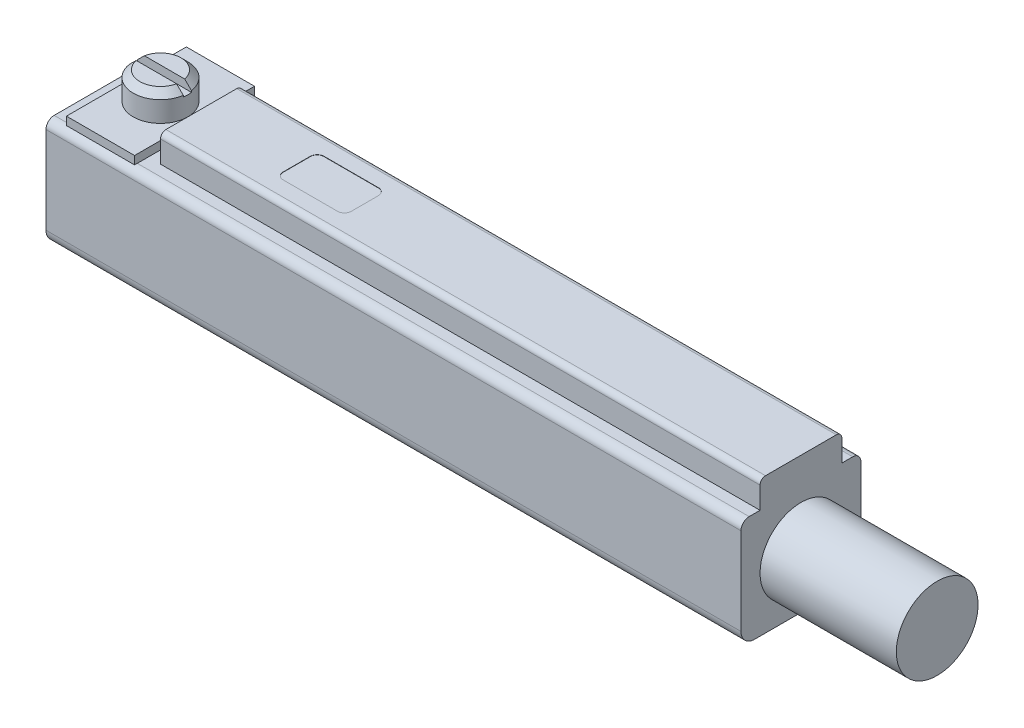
ISO-10303-21;
HEADER;
FILE_DESCRIPTION(('STEP AP214'),'2;1');
FILE_NAME('part.step','',(''),(''),'','','');
FILE_SCHEMA(('AUTOMOTIVE_DESIGN { 1 0 10303 214 1 1 1 1 }'));
ENDSEC;
DATA;
#1=APPLICATION_CONTEXT('core data for automotive mechanical design processes');
#2=APPLICATION_PROTOCOL_DEFINITION('international standard','automotive_design',2000,#1);
#3=PRODUCT_CONTEXT('',#1,'mechanical');
#4=PRODUCT('Part','Part','',(#3));
#5=PRODUCT_RELATED_PRODUCT_CATEGORY('part','',(#4));
#6=PRODUCT_DEFINITION_FORMATION('','',#4);
#7=PRODUCT_DEFINITION_CONTEXT('part definition',#1,'design');
#8=PRODUCT_DEFINITION('design','',#6,#7);
#9=PRODUCT_DEFINITION_SHAPE('','',#8);
#10=(LENGTH_UNIT() NAMED_UNIT(*) SI_UNIT(.MILLI.,.METRE.));
#11=(NAMED_UNIT(*) PLANE_ANGLE_UNIT() SI_UNIT($,.RADIAN.));
#12=(NAMED_UNIT(*) SI_UNIT($,.STERADIAN.) SOLID_ANGLE_UNIT());
#13=UNCERTAINTY_MEASURE_WITH_UNIT(LENGTH_MEASURE(1.E-05),#10,'distance_accuracy_value','');
#14=(GEOMETRIC_REPRESENTATION_CONTEXT(3) GLOBAL_UNCERTAINTY_ASSIGNED_CONTEXT((#13)) GLOBAL_UNIT_ASSIGNED_CONTEXT((#10,
#11,#12)) REPRESENTATION_CONTEXT('',''));
#15=CARTESIAN_POINT('',(0.,0.,0.));
#16=DIRECTION('',(0.,0.,1.));
#17=DIRECTION('',(1.,0.,0.));
#18=AXIS2_PLACEMENT_3D('',#15,#16,#17);
#19=CARTESIAN_POINT('',(0.75,5.5,0.150000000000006));
#20=DIRECTION('',(0.,0.,1.));
#21=DIRECTION('',(0.,-1.,0.));
#22=AXIS2_PLACEMENT_3D('',#19,#20,#21);
#23=PLANE('',#22);
#24=DIRECTION('',(0.,-1.,0.));
#25=VECTOR('',#24,1.);
#26=CARTESIAN_POINT('',(1.01131400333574,5.5,0.150000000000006));
#27=LINE('',#26,#25);
#28=CARTESIAN_POINT('',(1.01131400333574,5.25450000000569,0.150000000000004));
#29=VERTEX_POINT('',#28);
#30=CARTESIAN_POINT('',(1.01131400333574,5.2,0.150000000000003));
#31=VERTEX_POINT('',#30);
#32=EDGE_CURVE('E227',#29,#31,#27,.T.);
#33=ORIENTED_EDGE('',*,*,#32,.F.);
#34=CARTESIAN_POINT('',(1.26056085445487,5.49999999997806,0.150000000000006));
#35=CARTESIAN_POINT('',(1.2189316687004,5.45917270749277,0.150000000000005));
#36=CARTESIAN_POINT('',(1.17734650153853,5.41830072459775,0.150000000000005));
#37=CARTESIAN_POINT('',(1.09426421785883,5.33646739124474,0.150000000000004));
#38=CARTESIAN_POINT('',(1.05276710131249,5.29550604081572,0.150000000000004));
#39=CARTESIAN_POINT('',(1.01131400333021,5.25450000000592,0.150000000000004));
#40=B_SPLINE_CURVE_WITH_KNOTS('',3,(#34,#35,#36,#37,#38,#39),.UNSPECIFIED.,.F.,.F.,(4,2,4),(0.,
0.174924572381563,0.349849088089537),.UNSPECIFIED.);
#41=CARTESIAN_POINT('',(1.26056085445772,5.49999999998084,0.150000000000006));
#42=VERTEX_POINT('',#41);
#43=EDGE_CURVE('E209',#42,#29,#40,.T.);
#44=ORIENTED_EDGE('',*,*,#43,.F.);
#45=DIRECTION('',(1.,0.,0.));
#46=VECTOR('',#45,1.);
#47=CARTESIAN_POINT('',(0.75,5.5,0.150000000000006));
#48=LINE('',#47,#46);
#49=CARTESIAN_POINT('',(2.73943914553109,5.49999999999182,0.150000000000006));
#50=VERTEX_POINT('',#49);
#51=EDGE_CURVE('E206',#50,#42,#48,.F.);
#52=ORIENTED_EDGE('',*,*,#51,.F.);
#53=CARTESIAN_POINT('',(2.98868599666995,5.25450000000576,0.150000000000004));
#54=CARTESIAN_POINT('',(2.94723289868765,5.29550604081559,0.150000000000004));
#55=CARTESIAN_POINT('',(2.90573578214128,5.33646739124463,0.150000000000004));
#56=CARTESIAN_POINT('',(2.82265349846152,5.41830072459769,0.150000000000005));
#57=CARTESIAN_POINT('',(2.78106833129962,5.45917270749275,0.150000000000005));
#58=CARTESIAN_POINT('',(2.73943914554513,5.49999999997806,0.150000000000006));
#59=B_SPLINE_CURVE_WITH_KNOTS('',3,(#53,#54,#55,#56,#57,#58),.UNSPECIFIED.,.F.,.F.,(4,2,4),(0.,
0.174924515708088,0.349849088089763),.UNSPECIFIED.);
#60=CARTESIAN_POINT('',(2.98868599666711,5.25450000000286,0.150000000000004));
#61=VERTEX_POINT('',#60);
#62=EDGE_CURVE('E21',#61,#50,#59,.T.);
#63=ORIENTED_EDGE('',*,*,#62,.F.);
#64=DIRECTION('',(0.,-1.,0.));
#65=VECTOR('',#64,1.);
#66=CARTESIAN_POINT('',(2.98868599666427,5.5,0.150000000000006));
#67=LINE('',#66,#65);
#68=CARTESIAN_POINT('',(2.98868599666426,5.2,0.150000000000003));
#69=VERTEX_POINT('',#68);
#70=EDGE_CURVE('E219',#69,#61,#67,.F.);
#71=ORIENTED_EDGE('',*,*,#70,.F.);
#72=DIRECTION('',(1.,0.,0.));
#73=VECTOR('',#72,1.);
#74=CARTESIAN_POINT('',(0.75,5.2,0.150000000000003));
#75=LINE('',#74,#73);
#76=EDGE_CURVE('E355',#69,#31,#75,.F.);
#77=ORIENTED_EDGE('',*,*,#76,.T.);
#78=EDGE_LOOP('',(#33,#44,#52,#63,#71,#77));
#79=FACE_BOUND('',#78,.T.);
#80=ADVANCED_FACE('F17',(#79),#23,.F.);
#81=CARTESIAN_POINT('',(0.75,5.2,0.150000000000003));
#82=DIRECTION('',(0.,-1.,0.));
#83=DIRECTION('',(0.,0.,-1.));
#84=AXIS2_PLACEMENT_3D('',#81,#82,#83);
#85=PLANE('',#84);
#86=CARTESIAN_POINT('',(2.,5.2,0.));
#87=DIRECTION('',(0.,1.,0.));
#88=DIRECTION('',(0.,0.,1.));
#89=AXIS2_PLACEMENT_3D('',#86,#87,#88);
#90=CIRCLE('',#89,1.);
#91=CARTESIAN_POINT('',(1.01131400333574,5.2,-0.149999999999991));
#92=VERTEX_POINT('',#91);
#93=EDGE_CURVE('E356',#31,#92,#90,.F.);
#94=ORIENTED_EDGE('',*,*,#93,.F.);
#95=ORIENTED_EDGE('',*,*,#76,.F.);
#96=CARTESIAN_POINT('',(2.,5.2,0.));
#97=DIRECTION('',(0.,1.,0.));
#98=DIRECTION('',(0.,0.,1.));
#99=AXIS2_PLACEMENT_3D('',#96,#97,#98);
#100=CIRCLE('',#99,1.);
#101=CARTESIAN_POINT('',(2.98868599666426,5.2,-0.149999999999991));
#102=VERTEX_POINT('',#101);
#103=EDGE_CURVE('E228',#102,#69,#100,.F.);
#104=ORIENTED_EDGE('',*,*,#103,.F.);
#105=DIRECTION('',(-1.,0.,0.));
#106=VECTOR('',#105,1.);
#107=CARTESIAN_POINT('',(0.75,5.2,-0.149999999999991));
#108=LINE('',#107,#106);
#109=EDGE_CURVE('E368',#102,#92,#108,.T.);
#110=ORIENTED_EDGE('',*,*,#109,.T.);
#111=EDGE_LOOP('',(#94,#95,#104,#110));
#112=FACE_BOUND('',#111,.T.);
#113=ADVANCED_FACE('F380',(#112),#85,.F.);
#114=CARTESIAN_POINT('',(0.75,5.2,-0.149999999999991));
#115=DIRECTION('',(0.,0.,-1.));
#116=DIRECTION('',(-1.,0.,0.));
#117=AXIS2_PLACEMENT_3D('',#114,#115,#116);
#118=PLANE('',#117);
#119=DIRECTION('',(0.,1.,0.));
#120=VECTOR('',#119,1.);
#121=CARTESIAN_POINT('',(2.98868599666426,5.2,-0.149999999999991));
#122=LINE('',#121,#120);
#123=CARTESIAN_POINT('',(2.98868599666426,5.25450000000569,-0.149999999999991));
#124=VERTEX_POINT('',#123);
#125=EDGE_CURVE('E329',#124,#102,#122,.F.);
#126=ORIENTED_EDGE('',*,*,#125,.F.);
#127=CARTESIAN_POINT('',(2.73943914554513,5.49999999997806,-0.149999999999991));
#128=CARTESIAN_POINT('',(2.78106833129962,5.45917270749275,-0.149999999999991));
#129=CARTESIAN_POINT('',(2.82265349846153,5.41830072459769,-0.149999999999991));
#130=CARTESIAN_POINT('',(2.90573578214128,5.33646739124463,-0.149999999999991));
#131=CARTESIAN_POINT('',(2.94723289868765,5.29550604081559,-0.149999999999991));
#132=CARTESIAN_POINT('',(2.98868599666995,5.25450000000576,-0.149999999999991));
#133=B_SPLINE_CURVE_WITH_KNOTS('',3,(#127,#128,#129,#130,#131,#132),.UNSPECIFIED.,.F.,.F.,(4,2,
4),(0.,0.174924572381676,0.349849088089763),.UNSPECIFIED.);
#134=CARTESIAN_POINT('',(2.73943914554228,5.49999999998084,-0.149999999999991));
#135=VERTEX_POINT('',#134);
#136=EDGE_CURVE('E321',#135,#124,#133,.T.);
#137=ORIENTED_EDGE('',*,*,#136,.F.);
#138=DIRECTION('',(1.,0.,0.));
#139=VECTOR('',#138,1.);
#140=CARTESIAN_POINT('',(2.,5.5,-0.149999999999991));
#141=LINE('',#140,#139);
#142=CARTESIAN_POINT('',(1.26056085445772,5.49999999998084,-0.149999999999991));
#143=VERTEX_POINT('',#142);
#144=EDGE_CURVE('E216',#135,#143,#141,.F.);
#145=ORIENTED_EDGE('',*,*,#144,.T.);
#146=CARTESIAN_POINT('',(1.01131400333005,5.25450000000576,-0.149999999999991));
#147=CARTESIAN_POINT('',(1.05276710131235,5.29550604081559,-0.149999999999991));
#148=CARTESIAN_POINT('',(1.09426421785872,5.33646739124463,-0.149999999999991));
#149=CARTESIAN_POINT('',(1.17734650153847,5.41830072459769,-0.149999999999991));
#150=CARTESIAN_POINT('',(1.21893166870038,5.45917270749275,-0.149999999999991));
#151=CARTESIAN_POINT('',(1.26056085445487,5.49999999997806,-0.149999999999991));
#152=B_SPLINE_CURVE_WITH_KNOTS('',3,(#146,#147,#148,#149,#150,#151),.UNSPECIFIED.,.F.,.F.,(4,2,
4),(0.,0.174924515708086,0.34984908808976),.UNSPECIFIED.);
#153=CARTESIAN_POINT('',(1.01131400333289,5.25450000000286,-0.149999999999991));
#154=VERTEX_POINT('',#153);
#155=EDGE_CURVE('E330',#154,#143,#152,.T.);
#156=ORIENTED_EDGE('',*,*,#155,.F.);
#157=DIRECTION('',(0.,1.,0.));
#158=VECTOR('',#157,1.);
#159=CARTESIAN_POINT('',(1.01131400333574,5.2,-0.149999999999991));
#160=LINE('',#159,#158);
#161=EDGE_CURVE('E225',#92,#154,#160,.T.);
#162=ORIENTED_EDGE('',*,*,#161,.F.);
#163=ORIENTED_EDGE('',*,*,#109,.F.);
#164=EDGE_LOOP('',(#126,#137,#145,#156,#162,#163));
#165=FACE_BOUND('',#164,.T.);
#166=ADVANCED_FACE('F335',(#165),#118,.F.);
#167=CARTESIAN_POINT('',(2.,5.5,0.));
#168=DIRECTION('',(0.,-1.,0.));
#169=DIRECTION('',(0.,0.,-1.));
#170=AXIS2_PLACEMENT_3D('',#167,#168,#169);
#171=PLANE('',#170);
#172=ORIENTED_EDGE('',*,*,#51,.T.);
#173=CARTESIAN_POINT('',(2.,5.49999999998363,0.));
#174=DIRECTION('',(0.,-1.,0.));
#175=DIRECTION('',(0.,0.,-1.));
#176=AXIS2_PLACEMENT_3D('',#173,#174,#175);
#177=CIRCLE('',#176,0.754499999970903);
#178=EDGE_CURVE('E213',#50,#42,#177,.T.);
#179=ORIENTED_EDGE('',*,*,#178,.F.);
#180=EDGE_LOOP('',(#172,#179));
#181=FACE_BOUND('',#180,.T.);
#182=ADVANCED_FACE('F214',(#181),#171,.F.);
#183=CARTESIAN_POINT('',(2.,5.5,0.));
#184=DIRECTION('',(0.,-1.,0.));
#185=DIRECTION('',(0.,0.,-1.));
#186=AXIS2_PLACEMENT_3D('',#183,#184,#185);
#187=PLANE('',#186);
#188=CARTESIAN_POINT('',(2.,5.49999999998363,0.));
#189=DIRECTION('',(0.,-1.,0.));
#190=DIRECTION('',(0.,0.,-1.));
#191=AXIS2_PLACEMENT_3D('',#188,#189,#190);
#192=CIRCLE('',#191,0.754499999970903);
#193=EDGE_CURVE('E215',#143,#135,#192,.T.);
#194=ORIENTED_EDGE('',*,*,#193,.F.);
#195=ORIENTED_EDGE('',*,*,#144,.F.);
#196=EDGE_LOOP('',(#194,#195));
#197=FACE_BOUND('',#196,.T.);
#198=ADVANCED_FACE('F349',(#197),#187,.F.);
#199=CARTESIAN_POINT('',(2.,5.25450000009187,0.));
#200=DIRECTION('',(0.,-1.,0.));
#201=DIRECTION('',(0.,0.,-1.));
#202=AXIS2_PLACEMENT_3D('',#199,#200,#201);
#203=CONICAL_SURFACE('',#202,0.999999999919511,0.785398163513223);
#204=ORIENTED_EDGE('',*,*,#178,.T.);
#205=ORIENTED_EDGE('',*,*,#43,.T.);
#206=CARTESIAN_POINT('',(2.,5.2545,0.));
#207=DIRECTION('',(0.,1.,0.));
#208=DIRECTION('',(0.,0.,1.));
#209=AXIS2_PLACEMENT_3D('',#206,#207,#208);
#210=CIRCLE('',#209,1.);
#211=EDGE_CURVE('E201',#61,#29,#210,.F.);
#212=ORIENTED_EDGE('',*,*,#211,.F.);
#213=ORIENTED_EDGE('',*,*,#62,.T.);
#214=EDGE_LOOP('',(#204,#205,#212,#213));
#215=FACE_BOUND('',#214,.T.);
#216=ADVANCED_FACE('F218',(#215),#203,.T.);
#217=CARTESIAN_POINT('',(2.,5.25450000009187,0.));
#218=DIRECTION('',(0.,-1.,0.));
#219=DIRECTION('',(0.,0.,-1.));
#220=AXIS2_PLACEMENT_3D('',#217,#218,#219);
#221=CONICAL_SURFACE('',#220,0.999999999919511,0.785398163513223);
#222=CARTESIAN_POINT('',(2.,5.25449999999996,0.));
#223=DIRECTION('',(0.,1.,0.));
#224=DIRECTION('',(0.,0.,1.));
#225=AXIS2_PLACEMENT_3D('',#222,#223,#224);
#226=CIRCLE('',#225,1.);
#227=EDGE_CURVE('E319',#154,#124,#226,.F.);
#228=ORIENTED_EDGE('',*,*,#227,.F.);
#229=ORIENTED_EDGE('',*,*,#155,.T.);
#230=ORIENTED_EDGE('',*,*,#193,.T.);
#231=ORIENTED_EDGE('',*,*,#136,.T.);
#232=EDGE_LOOP('',(#228,#229,#230,#231));
#233=FACE_BOUND('',#232,.T.);
#234=ADVANCED_FACE('F338',(#233),#221,.T.);
#235=CARTESIAN_POINT('',(2.,3.9,0.));
#236=DIRECTION('',(0.,1.,0.));
#237=DIRECTION('',(0.,0.,1.));
#238=AXIS2_PLACEMENT_3D('',#235,#236,#237);
#239=CYLINDRICAL_SURFACE('',#238,1.);
#240=CARTESIAN_POINT('',(2.,4.50000000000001,0.));
#241=DIRECTION('',(0.,1.,0.));
#242=DIRECTION('',(0.,0.,1.));
#243=AXIS2_PLACEMENT_3D('',#240,#241,#242);
#244=CIRCLE('',#243,1.);
#245=CARTESIAN_POINT('',(2.,4.50000000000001,1.00000000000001));
#246=VERTEX_POINT('',#245);
#247=EDGE_CURVE('E315',#246,#246,#244,.T.);
#248=ORIENTED_EDGE('',*,*,#247,.T.);
#249=EDGE_LOOP('',(#248));
#250=FACE_BOUND('',#249,.T.);
#251=ORIENTED_EDGE('',*,*,#161,.T.);
#252=ORIENTED_EDGE('',*,*,#227,.T.);
#253=ORIENTED_EDGE('',*,*,#125,.T.);
#254=ORIENTED_EDGE('',*,*,#103,.T.);
#255=ORIENTED_EDGE('',*,*,#70,.T.);
#256=ORIENTED_EDGE('',*,*,#211,.T.);
#257=ORIENTED_EDGE('',*,*,#32,.T.);
#258=ORIENTED_EDGE('',*,*,#93,.T.);
#259=EDGE_LOOP('',(#251,#252,#253,#254,#255,#256,#257,#258));
#260=FACE_BOUND('',#259,.T.);
#261=ADVANCED_FACE('F342',(#250,#260),#239,.T.);
#262=CARTESIAN_POINT('',(3.25,4.5,-2.2));
#263=DIRECTION('',(0.,-1.,0.));
#264=DIRECTION('',(0.,0.,-1.));
#265=AXIS2_PLACEMENT_3D('',#262,#263,#264);
#266=PLANE('',#265);
#267=ORIENTED_EDGE('',*,*,#247,.F.);
#268=EDGE_LOOP('',(#267));
#269=FACE_BOUND('',#268,.T.);
#270=DIRECTION('',(0.,0.,-1.));
#271=VECTOR('',#270,1.);
#272=CARTESIAN_POINT('',(0.75,4.5,0.));
#273=LINE('',#272,#271);
#274=CARTESIAN_POINT('',(0.75,4.5,-2.2));
#275=VERTEX_POINT('',#274);
#276=CARTESIAN_POINT('',(0.75,4.5,2.2));
#277=VERTEX_POINT('',#276);
#278=EDGE_CURVE('E535',#275,#277,#273,.F.);
#279=ORIENTED_EDGE('',*,*,#278,.T.);
#280=DIRECTION('',(-1.,0.,0.));
#281=VECTOR('',#280,1.);
#282=CARTESIAN_POINT('',(3.25,4.5,2.2));
#283=LINE('',#282,#281);
#284=CARTESIAN_POINT('',(3.25,4.5,2.2));
#285=VERTEX_POINT('',#284);
#286=EDGE_CURVE('E539',#277,#285,#283,.F.);
#287=ORIENTED_EDGE('',*,*,#286,.T.);
#288=DIRECTION('',(0.,0.,-1.));
#289=VECTOR('',#288,1.);
#290=CARTESIAN_POINT('',(3.25,4.5,0.));
#291=LINE('',#290,#289);
#292=CARTESIAN_POINT('',(3.25,4.5,-2.2));
#293=VERTEX_POINT('',#292);
#294=EDGE_CURVE('E318',#293,#285,#291,.F.);
#295=ORIENTED_EDGE('',*,*,#294,.F.);
#296=DIRECTION('',(1.,0.,0.));
#297=VECTOR('',#296,1.);
#298=CARTESIAN_POINT('',(3.25,4.5,-2.2));
#299=LINE('',#298,#297);
#300=EDGE_CURVE('E542',#293,#275,#299,.F.);
#301=ORIENTED_EDGE('',*,*,#300,.T.);
#302=EDGE_LOOP('',(#279,#287,#295,#301));
#303=FACE_BOUND('',#302,.T.);
#304=ADVANCED_FACE('F520',(#269,#303),#266,.F.);
#305=CARTESIAN_POINT('',(3.25,0.,0.));
#306=DIRECTION('',(1.,0.,0.));
#307=DIRECTION('',(0.,0.,-1.));
#308=AXIS2_PLACEMENT_3D('',#305,#306,#307);
#309=PLANE('',#308);
#310=DIRECTION('',(0.,1.,0.));
#311=VECTOR('',#310,1.);
#312=CARTESIAN_POINT('',(3.25,4.2,-2.2));
#313=LINE('',#312,#311);
#314=CARTESIAN_POINT('',(3.25,4.2,-2.2));
#315=VERTEX_POINT('',#314);
#316=EDGE_CURVE('E568',#315,#293,#313,.T.);
#317=ORIENTED_EDGE('',*,*,#316,.T.);
#318=ORIENTED_EDGE('',*,*,#294,.T.);
#319=DIRECTION('',(0.,1.,0.));
#320=VECTOR('',#319,1.);
#321=CARTESIAN_POINT('',(3.25,4.5,2.2));
#322=LINE('',#321,#320);
#323=CARTESIAN_POINT('',(3.25,4.2,2.2));
#324=VERTEX_POINT('',#323);
#325=EDGE_CURVE('E548',#285,#324,#322,.F.);
#326=ORIENTED_EDGE('',*,*,#325,.T.);
#327=DIRECTION('',(0.,0.,1.));
#328=VECTOR('',#327,1.);
#329=CARTESIAN_POINT('',(3.25,4.2,2.2));
#330=LINE('',#329,#328);
#331=EDGE_CURVE('E557',#324,#315,#330,.F.);
#332=ORIENTED_EDGE('',*,*,#331,.T.);
#333=EDGE_LOOP('',(#317,#318,#326,#332));
#334=FACE_BOUND('',#333,.T.);
#335=ADVANCED_FACE('F517',(#334),#309,.T.);
#336=CARTESIAN_POINT('',(3.25,4.2,-2.2));
#337=DIRECTION('',(0.,0.,1.));
#338=DIRECTION('',(1.,0.,0.));
#339=AXIS2_PLACEMENT_3D('',#336,#337,#338);
#340=PLANE('',#339);
#341=DIRECTION('',(0.,1.,0.));
#342=VECTOR('',#341,1.);
#343=CARTESIAN_POINT('',(0.75,0.,-2.2));
#344=LINE('',#343,#342);
#345=CARTESIAN_POINT('',(0.75,4.2,-2.2));
#346=VERTEX_POINT('',#345);
#347=EDGE_CURVE('E549',#346,#275,#344,.T.);
#348=ORIENTED_EDGE('',*,*,#347,.T.);
#349=ORIENTED_EDGE('',*,*,#300,.F.);
#350=ORIENTED_EDGE('',*,*,#316,.F.);
#351=DIRECTION('',(1.,0.,0.));
#352=VECTOR('',#351,1.);
#353=CARTESIAN_POINT('',(3.25,4.2,-2.2));
#354=LINE('',#353,#352);
#355=EDGE_CURVE('E583',#315,#346,#354,.F.);
#356=ORIENTED_EDGE('',*,*,#355,.T.);
#357=EDGE_LOOP('',(#348,#349,#350,#356));
#358=FACE_BOUND('',#357,.T.);
#359=ADVANCED_FACE('F513',(#358),#340,.F.);
#360=CARTESIAN_POINT('',(0.75,0.,0.));
#361=DIRECTION('',(1.,0.,0.));
#362=DIRECTION('',(0.,0.,-1.));
#363=AXIS2_PLACEMENT_3D('',#360,#361,#362);
#364=PLANE('',#363);
#365=ORIENTED_EDGE('',*,*,#278,.F.);
#366=ORIENTED_EDGE('',*,*,#347,.F.);
#367=DIRECTION('',(0.,0.,1.));
#368=VECTOR('',#367,1.);
#369=CARTESIAN_POINT('',(0.75,4.2,2.2));
#370=LINE('',#369,#368);
#371=CARTESIAN_POINT('',(0.75,4.2,2.2));
#372=VERTEX_POINT('',#371);
#373=EDGE_CURVE('E561',#346,#372,#370,.T.);
#374=ORIENTED_EDGE('',*,*,#373,.T.);
#375=DIRECTION('',(0.,1.,0.));
#376=VECTOR('',#375,1.);
#377=CARTESIAN_POINT('',(0.75,4.5,2.2));
#378=LINE('',#377,#376);
#379=EDGE_CURVE('E554',#372,#277,#378,.T.);
#380=ORIENTED_EDGE('',*,*,#379,.T.);
#381=EDGE_LOOP('',(#365,#366,#374,#380));
#382=FACE_BOUND('',#381,.T.);
#383=ADVANCED_FACE('F509',(#382),#364,.F.);
#384=CARTESIAN_POINT('',(3.25,4.5,2.2));
#385=DIRECTION('',(0.,0.,-1.));
#386=DIRECTION('',(-1.,0.,0.));
#387=AXIS2_PLACEMENT_3D('',#384,#385,#386);
#388=PLANE('',#387);
#389=ORIENTED_EDGE('',*,*,#379,.F.);
#390=DIRECTION('',(1.,0.,0.));
#391=VECTOR('',#390,1.);
#392=CARTESIAN_POINT('',(3.25,4.2,2.2));
#393=LINE('',#392,#391);
#394=EDGE_CURVE('E314',#372,#324,#393,.T.);
#395=ORIENTED_EDGE('',*,*,#394,.T.);
#396=ORIENTED_EDGE('',*,*,#325,.F.);
#397=ORIENTED_EDGE('',*,*,#286,.F.);
#398=EDGE_LOOP('',(#389,#395,#396,#397));
#399=FACE_BOUND('',#398,.T.);
#400=ADVANCED_FACE('F505',(#399),#388,.F.);
#401=CARTESIAN_POINT('',(7.25,4.99,0.5));
#402=DIRECTION('',(0.,1.,0.));
#403=DIRECTION('',(0.,0.,1.));
#404=AXIS2_PLACEMENT_3D('',#401,#402,#403);
#405=PLANE('',#404);
#406=CARTESIAN_POINT('',(7.25,4.99,-0.500000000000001));
#407=DIRECTION('',(0.,1.,0.));
#408=DIRECTION('',(0.,0.,1.));
#409=AXIS2_PLACEMENT_3D('',#406,#407,#408);
#410=CIRCLE('',#409,0.249999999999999);
#411=CARTESIAN_POINT('',(7.25,4.99,-0.75));
#412=VERTEX_POINT('',#411);
#413=CARTESIAN_POINT('',(7.,4.99,-0.5));
#414=VERTEX_POINT('',#413);
#415=EDGE_CURVE('E303',#412,#414,#410,.T.);
#416=ORIENTED_EDGE('',*,*,#415,.T.);
#417=DIRECTION('',(0.,0.,1.));
#418=VECTOR('',#417,1.);
#419=CARTESIAN_POINT('',(7.,4.99,-0.5));
#420=LINE('',#419,#418);
#421=CARTESIAN_POINT('',(7.,4.99,0.5));
#422=VERTEX_POINT('',#421);
#423=EDGE_CURVE('E600',#414,#422,#420,.T.);
#424=ORIENTED_EDGE('',*,*,#423,.T.);
#425=CARTESIAN_POINT('',(7.25,4.99,0.5));
#426=DIRECTION('',(0.,1.,0.));
#427=DIRECTION('',(0.,0.,1.));
#428=AXIS2_PLACEMENT_3D('',#425,#426,#427);
#429=CIRCLE('',#428,0.25);
#430=CARTESIAN_POINT('',(7.25,4.99,0.75));
#431=VERTEX_POINT('',#430);
#432=EDGE_CURVE('E300',#422,#431,#429,.T.);
#433=ORIENTED_EDGE('',*,*,#432,.T.);
#434=DIRECTION('',(1.,0.,0.));
#435=VECTOR('',#434,1.);
#436=CARTESIAN_POINT('',(7.25,4.99,0.75));
#437=LINE('',#436,#435);
#438=CARTESIAN_POINT('',(9.25,4.99,0.75));
#439=VERTEX_POINT('',#438);
#440=EDGE_CURVE('E299',#431,#439,#437,.T.);
#441=ORIENTED_EDGE('',*,*,#440,.T.);
#442=CARTESIAN_POINT('',(9.25,4.99,0.500000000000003));
#443=DIRECTION('',(0.,1.,0.));
#444=DIRECTION('',(0.,0.,1.));
#445=AXIS2_PLACEMENT_3D('',#442,#443,#444);
#446=CIRCLE('',#445,0.249999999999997);
#447=CARTESIAN_POINT('',(9.5,4.99,0.500000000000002));
#448=VERTEX_POINT('',#447);
#449=EDGE_CURVE('E311',#439,#448,#446,.T.);
#450=ORIENTED_EDGE('',*,*,#449,.T.);
#451=DIRECTION('',(0.,0.,-1.));
#452=VECTOR('',#451,1.);
#453=CARTESIAN_POINT('',(9.5,4.99,0.5));
#454=LINE('',#453,#452);
#455=CARTESIAN_POINT('',(9.5,4.99,-0.5));
#456=VERTEX_POINT('',#455);
#457=EDGE_CURVE('E603',#448,#456,#454,.T.);
#458=ORIENTED_EDGE('',*,*,#457,.T.);
#459=CARTESIAN_POINT('',(9.25,4.99,-0.500000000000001));
#460=DIRECTION('',(0.,1.,0.));
#461=DIRECTION('',(0.,0.,1.));
#462=AXIS2_PLACEMENT_3D('',#459,#460,#461);
#463=CIRCLE('',#462,0.249999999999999);
#464=CARTESIAN_POINT('',(9.25,4.99,-0.75));
#465=VERTEX_POINT('',#464);
#466=EDGE_CURVE('E307',#456,#465,#463,.T.);
#467=ORIENTED_EDGE('',*,*,#466,.T.);
#468=DIRECTION('',(-1.,0.,0.));
#469=VECTOR('',#468,1.);
#470=CARTESIAN_POINT('',(9.25,4.99,-0.75));
#471=LINE('',#470,#469);
#472=EDGE_CURVE('E602',#465,#412,#471,.T.);
#473=ORIENTED_EDGE('',*,*,#472,.T.);
#474=EDGE_LOOP('',(#416,#424,#433,#441,#450,#458,#467,#473));
#475=FACE_BOUND('',#474,.T.);
#476=ADVANCED_FACE('F501',(#475),#405,.T.);
#477=CARTESIAN_POINT('',(3.25,4.2,2.2));
#478=DIRECTION('',(0.,1.,0.));
#479=DIRECTION('',(0.,0.,1.));
#480=AXIS2_PLACEMENT_3D('',#477,#478,#479);
#481=PLANE('',#480);
#482=CARTESIAN_POINT('',(2.,4.2,0.));
#483=DIRECTION('',(0.,1.,0.));
#484=DIRECTION('',(0.,0.,1.));
#485=AXIS2_PLACEMENT_3D('',#482,#483,#484);
#486=CIRCLE('',#485,1.);
#487=CARTESIAN_POINT('',(2.,4.20000000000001,1.00000000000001));
#488=VERTEX_POINT('',#487);
#489=EDGE_CURVE('E272',#488,#488,#486,.F.);
#490=ORIENTED_EDGE('',*,*,#489,.F.);
#491=EDGE_LOOP('',(#490));
#492=FACE_BOUND('',#491,.T.);
#493=ORIENTED_EDGE('',*,*,#373,.F.);
#494=ORIENTED_EDGE('',*,*,#355,.F.);
#495=ORIENTED_EDGE('',*,*,#331,.F.);
#496=ORIENTED_EDGE('',*,*,#394,.F.);
#497=EDGE_LOOP('',(#493,#494,#495,#496));
#498=FACE_BOUND('',#497,.T.);
#499=ADVANCED_FACE('F497',(#492,#498),#481,.F.);
#500=CARTESIAN_POINT('',(9.25,4.99,0.500000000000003));
#501=DIRECTION('',(0.,1.,0.));
#502=DIRECTION('',(0.,0.,1.));
#503=AXIS2_PLACEMENT_3D('',#500,#501,#502);
#504=CYLINDRICAL_SURFACE('',#503,0.249999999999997);
#505=DIRECTION('',(0.,1.,0.));
#506=VECTOR('',#505,1.);
#507=CARTESIAN_POINT('',(9.5,4.99,0.5));
#508=LINE('',#507,#506);
#509=CARTESIAN_POINT('',(9.5,5.,0.500000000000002));
#510=VERTEX_POINT('',#509);
#511=EDGE_CURVE('E313',#510,#448,#508,.F.);
#512=ORIENTED_EDGE('',*,*,#511,.T.);
#513=ORIENTED_EDGE('',*,*,#449,.F.);
#514=DIRECTION('',(0.,1.,0.));
#515=VECTOR('',#514,1.);
#516=CARTESIAN_POINT('',(9.25,4.99,0.75));
#517=LINE('',#516,#515);
#518=CARTESIAN_POINT('',(9.25,5.,0.75));
#519=VERTEX_POINT('',#518);
#520=EDGE_CURVE('E295',#439,#519,#517,.T.);
#521=ORIENTED_EDGE('',*,*,#520,.T.);
#522=CARTESIAN_POINT('',(9.25,5.,0.500000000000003));
#523=DIRECTION('',(0.,1.,0.));
#524=DIRECTION('',(0.,0.,1.));
#525=AXIS2_PLACEMENT_3D('',#522,#523,#524);
#526=CIRCLE('',#525,0.249999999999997);
#527=EDGE_CURVE('E269',#519,#510,#526,.T.);
#528=ORIENTED_EDGE('',*,*,#527,.T.);
#529=EDGE_LOOP('',(#512,#513,#521,#528));
#530=FACE_BOUND('',#529,.T.);
#531=ADVANCED_FACE('F493',(#530),#504,.F.);
#532=CARTESIAN_POINT('',(9.5,4.99,0.5));
#533=DIRECTION('',(1.,0.,0.));
#534=DIRECTION('',(0.,0.,-1.));
#535=AXIS2_PLACEMENT_3D('',#532,#533,#534);
#536=PLANE('',#535);
#537=DIRECTION('',(0.,1.,0.));
#538=VECTOR('',#537,1.);
#539=CARTESIAN_POINT('',(9.5,4.99,-0.5));
#540=LINE('',#539,#538);
#541=CARTESIAN_POINT('',(9.5,5.,-0.5));
#542=VERTEX_POINT('',#541);
#543=EDGE_CURVE('E310',#542,#456,#540,.F.);
#544=ORIENTED_EDGE('',*,*,#543,.T.);
#545=ORIENTED_EDGE('',*,*,#457,.F.);
#546=ORIENTED_EDGE('',*,*,#511,.F.);
#547=DIRECTION('',(0.,0.,-1.));
#548=VECTOR('',#547,1.);
#549=CARTESIAN_POINT('',(9.5,5.,-1.3));
#550=LINE('',#549,#548);
#551=EDGE_CURVE('E268',#510,#542,#550,.T.);
#552=ORIENTED_EDGE('',*,*,#551,.T.);
#553=EDGE_LOOP('',(#544,#545,#546,#552));
#554=FACE_BOUND('',#553,.T.);
#555=ADVANCED_FACE('F489',(#554),#536,.F.);
#556=CARTESIAN_POINT('',(9.25,4.99,-0.500000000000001));
#557=DIRECTION('',(0.,1.,0.));
#558=DIRECTION('',(0.,0.,1.));
#559=AXIS2_PLACEMENT_3D('',#556,#557,#558);
#560=CYLINDRICAL_SURFACE('',#559,0.249999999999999);
#561=DIRECTION('',(0.,1.,0.));
#562=VECTOR('',#561,1.);
#563=CARTESIAN_POINT('',(9.25,4.99,-0.75));
#564=LINE('',#563,#562);
#565=CARTESIAN_POINT('',(9.25,5.,-0.75));
#566=VERTEX_POINT('',#565);
#567=EDGE_CURVE('E309',#566,#465,#564,.F.);
#568=ORIENTED_EDGE('',*,*,#567,.T.);
#569=ORIENTED_EDGE('',*,*,#466,.F.);
#570=ORIENTED_EDGE('',*,*,#543,.F.);
#571=CARTESIAN_POINT('',(9.25,5.,-0.500000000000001));
#572=DIRECTION('',(0.,1.,0.));
#573=DIRECTION('',(0.,0.,1.));
#574=AXIS2_PLACEMENT_3D('',#571,#572,#573);
#575=CIRCLE('',#574,0.249999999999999);
#576=EDGE_CURVE('E265',#542,#566,#575,.T.);
#577=ORIENTED_EDGE('',*,*,#576,.T.);
#578=EDGE_LOOP('',(#568,#569,#570,#577));
#579=FACE_BOUND('',#578,.T.);
#580=ADVANCED_FACE('F485',(#579),#560,.F.);
#581=CARTESIAN_POINT('',(9.25,4.99,-0.75));
#582=DIRECTION('',(0.,0.,-1.));
#583=DIRECTION('',(-1.,0.,0.));
#584=AXIS2_PLACEMENT_3D('',#581,#582,#583);
#585=PLANE('',#584);
#586=DIRECTION('',(0.,1.,0.));
#587=VECTOR('',#586,1.);
#588=CARTESIAN_POINT('',(7.25,4.99,-0.75));
#589=LINE('',#588,#587);
#590=CARTESIAN_POINT('',(7.25,5.,-0.75));
#591=VERTEX_POINT('',#590);
#592=EDGE_CURVE('E306',#591,#412,#589,.F.);
#593=ORIENTED_EDGE('',*,*,#592,.T.);
#594=ORIENTED_EDGE('',*,*,#472,.F.);
#595=ORIENTED_EDGE('',*,*,#567,.F.);
#596=DIRECTION('',(1.,0.,0.));
#597=VECTOR('',#596,1.);
#598=CARTESIAN_POINT('',(25.5,5.,-0.75));
#599=LINE('',#598,#597);
#600=EDGE_CURVE('E264',#566,#591,#599,.F.);
#601=ORIENTED_EDGE('',*,*,#600,.T.);
#602=EDGE_LOOP('',(#593,#594,#595,#601));
#603=FACE_BOUND('',#602,.T.);
#604=ADVANCED_FACE('F481',(#603),#585,.F.);
#605=CARTESIAN_POINT('',(7.25,4.99,-0.500000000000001));
#606=DIRECTION('',(0.,1.,0.));
#607=DIRECTION('',(0.,0.,1.));
#608=AXIS2_PLACEMENT_3D('',#605,#606,#607);
#609=CYLINDRICAL_SURFACE('',#608,0.249999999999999);
#610=DIRECTION('',(0.,1.,0.));
#611=VECTOR('',#610,1.);
#612=CARTESIAN_POINT('',(7.,4.99,-0.5));
#613=LINE('',#612,#611);
#614=CARTESIAN_POINT('',(7.,5.,-0.5));
#615=VERTEX_POINT('',#614);
#616=EDGE_CURVE('E305',#615,#414,#613,.F.);
#617=ORIENTED_EDGE('',*,*,#616,.T.);
#618=ORIENTED_EDGE('',*,*,#415,.F.);
#619=ORIENTED_EDGE('',*,*,#592,.F.);
#620=CARTESIAN_POINT('',(7.25,5.,-0.500000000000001));
#621=DIRECTION('',(0.,1.,0.));
#622=DIRECTION('',(0.,0.,1.));
#623=AXIS2_PLACEMENT_3D('',#620,#621,#622);
#624=CIRCLE('',#623,0.249999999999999);
#625=EDGE_CURVE('E261',#591,#615,#624,.T.);
#626=ORIENTED_EDGE('',*,*,#625,.T.);
#627=EDGE_LOOP('',(#617,#618,#619,#626));
#628=FACE_BOUND('',#627,.T.);
#629=ADVANCED_FACE('F477',(#628),#609,.F.);
#630=CARTESIAN_POINT('',(7.,4.99,-0.5));
#631=DIRECTION('',(-1.,0.,0.));
#632=DIRECTION('',(0.,0.,1.));
#633=AXIS2_PLACEMENT_3D('',#630,#631,#632);
#634=PLANE('',#633);
#635=DIRECTION('',(0.,1.,0.));
#636=VECTOR('',#635,1.);
#637=CARTESIAN_POINT('',(7.,4.99,0.5));
#638=LINE('',#637,#636);
#639=CARTESIAN_POINT('',(7.,5.,0.5));
#640=VERTEX_POINT('',#639);
#641=EDGE_CURVE('E302',#640,#422,#638,.F.);
#642=ORIENTED_EDGE('',*,*,#641,.T.);
#643=ORIENTED_EDGE('',*,*,#423,.F.);
#644=ORIENTED_EDGE('',*,*,#616,.F.);
#645=DIRECTION('',(0.,0.,-1.));
#646=VECTOR('',#645,1.);
#647=CARTESIAN_POINT('',(7.,5.,-1.3));
#648=LINE('',#647,#646);
#649=EDGE_CURVE('E260',#615,#640,#648,.F.);
#650=ORIENTED_EDGE('',*,*,#649,.T.);
#651=EDGE_LOOP('',(#642,#643,#644,#650));
#652=FACE_BOUND('',#651,.T.);
#653=ADVANCED_FACE('F473',(#652),#634,.F.);
#654=CARTESIAN_POINT('',(7.25,4.99,0.5));
#655=DIRECTION('',(0.,1.,0.));
#656=DIRECTION('',(0.,0.,1.));
#657=AXIS2_PLACEMENT_3D('',#654,#655,#656);
#658=CYLINDRICAL_SURFACE('',#657,0.25);
#659=DIRECTION('',(0.,1.,0.));
#660=VECTOR('',#659,1.);
#661=CARTESIAN_POINT('',(7.25,4.99,0.75));
#662=LINE('',#661,#660);
#663=CARTESIAN_POINT('',(7.25,5.,0.75));
#664=VERTEX_POINT('',#663);
#665=EDGE_CURVE('E296',#664,#431,#662,.F.);
#666=ORIENTED_EDGE('',*,*,#665,.T.);
#667=ORIENTED_EDGE('',*,*,#432,.F.);
#668=ORIENTED_EDGE('',*,*,#641,.F.);
#669=CARTESIAN_POINT('',(7.25,5.,0.5));
#670=DIRECTION('',(0.,1.,0.));
#671=DIRECTION('',(0.,0.,1.));
#672=AXIS2_PLACEMENT_3D('',#669,#670,#671);
#673=CIRCLE('',#672,0.25);
#674=EDGE_CURVE('E256',#640,#664,#673,.T.);
#675=ORIENTED_EDGE('',*,*,#674,.T.);
#676=EDGE_LOOP('',(#666,#667,#668,#675));
#677=FACE_BOUND('',#676,.T.);
#678=ADVANCED_FACE('F469',(#677),#658,.F.);
#679=CARTESIAN_POINT('',(7.25,4.99,0.75));
#680=DIRECTION('',(0.,0.,1.));
#681=DIRECTION('',(1.,0.,0.));
#682=AXIS2_PLACEMENT_3D('',#679,#680,#681);
#683=PLANE('',#682);
#684=ORIENTED_EDGE('',*,*,#520,.F.);
#685=ORIENTED_EDGE('',*,*,#440,.F.);
#686=ORIENTED_EDGE('',*,*,#665,.F.);
#687=DIRECTION('',(1.,0.,0.));
#688=VECTOR('',#687,1.);
#689=CARTESIAN_POINT('',(25.5,5.,0.75));
#690=LINE('',#689,#688);
#691=EDGE_CURVE('E259',#664,#519,#690,.T.);
#692=ORIENTED_EDGE('',*,*,#691,.T.);
#693=EDGE_LOOP('',(#684,#685,#686,#692));
#694=FACE_BOUND('',#693,.T.);
#695=ADVANCED_FACE('F465',(#694),#683,.F.);
#696=CARTESIAN_POINT('',(25.5,4.80000000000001,1.30000000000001));
#697=DIRECTION('',(-1.,0.,0.));
#698=DIRECTION('',(0.,0.,1.));
#699=AXIS2_PLACEMENT_3D('',#696,#697,#698);
#700=CYLINDRICAL_SURFACE('',#699,0.199999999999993);
#701=DIRECTION('',(-1.,0.,0.));
#702=VECTOR('',#701,1.);
#703=CARTESIAN_POINT('',(25.5,4.8,1.5));
#704=LINE('',#703,#702);
#705=CARTESIAN_POINT('',(3.5,4.8,1.5));
#706=VERTEX_POINT('',#705);
#707=CARTESIAN_POINT('',(25.5,4.8,1.5));
#708=VERTEX_POINT('',#707);
#709=EDGE_CURVE('E279',#706,#708,#704,.F.);
#710=ORIENTED_EDGE('',*,*,#709,.T.);
#711=CARTESIAN_POINT('',(25.5,4.80000000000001,1.30000000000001));
#712=DIRECTION('',(-1.,0.,0.));
#713=DIRECTION('',(0.,0.,1.));
#714=AXIS2_PLACEMENT_3D('',#711,#712,#713);
#715=CIRCLE('',#714,0.199999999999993);
#716=CARTESIAN_POINT('',(25.5,5.,1.30000000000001));
#717=VERTEX_POINT('',#716);
#718=EDGE_CURVE('E293',#708,#717,#715,.T.);
#719=ORIENTED_EDGE('',*,*,#718,.T.);
#720=DIRECTION('',(1.,0.,0.));
#721=VECTOR('',#720,1.);
#722=CARTESIAN_POINT('',(25.5,5.,1.3));
#723=LINE('',#722,#721);
#724=CARTESIAN_POINT('',(3.5,5.,1.30000000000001));
#725=VERTEX_POINT('',#724);
#726=EDGE_CURVE('E623',#717,#725,#723,.F.);
#727=ORIENTED_EDGE('',*,*,#726,.T.);
#728=CARTESIAN_POINT('',(3.5,4.80000000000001,1.30000000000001));
#729=DIRECTION('',(-1.,0.,0.));
#730=DIRECTION('',(0.,0.,1.));
#731=AXIS2_PLACEMENT_3D('',#728,#729,#730);
#732=CIRCLE('',#731,0.199999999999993);
#733=EDGE_CURVE('E280',#725,#706,#732,.F.);
#734=ORIENTED_EDGE('',*,*,#733,.T.);
#735=EDGE_LOOP('',(#710,#719,#727,#734));
#736=FACE_BOUND('',#735,.T.);
#737=ADVANCED_FACE('F461',(#736),#700,.T.);
#738=CARTESIAN_POINT('',(25.5,4.80000000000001,-1.30000000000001));
#739=DIRECTION('',(-1.,0.,0.));
#740=DIRECTION('',(0.,0.,1.));
#741=AXIS2_PLACEMENT_3D('',#738,#739,#740);
#742=CYLINDRICAL_SURFACE('',#741,0.199999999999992);
#743=DIRECTION('',(1.,0.,0.));
#744=VECTOR('',#743,1.);
#745=CARTESIAN_POINT('',(25.5,5.,-1.3));
#746=LINE('',#745,#744);
#747=CARTESIAN_POINT('',(3.5,5.,-1.3));
#748=VERTEX_POINT('',#747);
#749=CARTESIAN_POINT('',(25.5,5.,-1.3));
#750=VERTEX_POINT('',#749);
#751=EDGE_CURVE('E255',#748,#750,#746,.T.);
#752=ORIENTED_EDGE('',*,*,#751,.T.);
#753=CARTESIAN_POINT('',(25.5,4.80000000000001,-1.30000000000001));
#754=DIRECTION('',(-1.,0.,0.));
#755=DIRECTION('',(0.,0.,1.));
#756=AXIS2_PLACEMENT_3D('',#753,#754,#755);
#757=CIRCLE('',#756,0.199999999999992);
#758=CARTESIAN_POINT('',(25.5,4.80000000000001,-1.5));
#759=VERTEX_POINT('',#758);
#760=EDGE_CURVE('E291',#750,#759,#757,.T.);
#761=ORIENTED_EDGE('',*,*,#760,.T.);
#762=DIRECTION('',(1.,0.,0.));
#763=VECTOR('',#762,1.);
#764=CARTESIAN_POINT('',(25.5,4.80000000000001,-1.5));
#765=LINE('',#764,#763);
#766=CARTESIAN_POINT('',(3.5,4.80000000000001,-1.5));
#767=VERTEX_POINT('',#766);
#768=EDGE_CURVE('E285',#759,#767,#765,.F.);
#769=ORIENTED_EDGE('',*,*,#768,.T.);
#770=CARTESIAN_POINT('',(3.5,4.80000000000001,-1.30000000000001));
#771=DIRECTION('',(-1.,0.,0.));
#772=DIRECTION('',(0.,0.,1.));
#773=AXIS2_PLACEMENT_3D('',#770,#771,#772);
#774=CIRCLE('',#773,0.199999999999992);
#775=EDGE_CURVE('E283',#767,#748,#774,.F.);
#776=ORIENTED_EDGE('',*,*,#775,.T.);
#777=EDGE_LOOP('',(#752,#761,#769,#776));
#778=FACE_BOUND('',#777,.T.);
#779=ADVANCED_FACE('F457',(#778),#742,.T.);
#780=CARTESIAN_POINT('',(30.5,2.,0.));
#781=DIRECTION('',(1.,0.,0.));
#782=DIRECTION('',(0.,0.,-1.));
#783=AXIS2_PLACEMENT_3D('',#780,#781,#782);
#784=PLANE('',#783);
#785=CARTESIAN_POINT('',(30.5,2.,0.));
#786=DIRECTION('',(-1.,0.,0.));
#787=DIRECTION('',(0.,0.,1.));
#788=AXIS2_PLACEMENT_3D('',#785,#786,#787);
#789=CIRCLE('',#788,1.5);
#790=CARTESIAN_POINT('',(30.5,2.,1.5));
#791=VERTEX_POINT('',#790);
#792=EDGE_CURVE('E251',#791,#791,#789,.T.);
#793=ORIENTED_EDGE('',*,*,#792,.F.);
#794=EDGE_LOOP('',(#793));
#795=FACE_BOUND('',#794,.T.);
#796=ADVANCED_FACE('F453',(#795),#784,.T.);
#797=CARTESIAN_POINT('',(25.5,3.7,-1.9));
#798=DIRECTION('',(-1.,0.,0.));
#799=DIRECTION('',(0.,0.,1.));
#800=AXIS2_PLACEMENT_3D('',#797,#798,#799);
#801=CYLINDRICAL_SURFACE('',#800,0.3);
#802=CARTESIAN_POINT('',(25.5,3.7,-1.9));
#803=DIRECTION('',(-1.,0.,0.));
#804=DIRECTION('',(0.,0.,1.));
#805=AXIS2_PLACEMENT_3D('',#802,#803,#804);
#806=CIRCLE('',#805,0.3);
#807=CARTESIAN_POINT('',(25.5,4.,-1.9));
#808=VERTEX_POINT('',#807);
#809=CARTESIAN_POINT('',(25.5,3.7,-2.2));
#810=VERTEX_POINT('',#809);
#811=EDGE_CURVE('E286',#808,#810,#806,.T.);
#812=ORIENTED_EDGE('',*,*,#811,.T.);
#813=DIRECTION('',(1.,0.,0.));
#814=VECTOR('',#813,1.);
#815=CARTESIAN_POINT('',(25.5,3.7,-2.2));
#816=LINE('',#815,#814);
#817=CARTESIAN_POINT('',(0.,3.7,-2.2));
#818=VERTEX_POINT('',#817);
#819=EDGE_CURVE('E671',#810,#818,#816,.F.);
#820=ORIENTED_EDGE('',*,*,#819,.T.);
#821=CARTESIAN_POINT('',(0.,3.7,-1.9));
#822=DIRECTION('',(-1.,0.,0.));
#823=DIRECTION('',(0.,0.,1.));
#824=AXIS2_PLACEMENT_3D('',#821,#822,#823);
#825=CIRCLE('',#824,0.3);
#826=CARTESIAN_POINT('',(0.,4.,-1.9));
#827=VERTEX_POINT('',#826);
#828=EDGE_CURVE('E289',#818,#827,#825,.F.);
#829=ORIENTED_EDGE('',*,*,#828,.T.);
#830=DIRECTION('',(1.,0.,0.));
#831=VECTOR('',#830,1.);
#832=CARTESIAN_POINT('',(25.5,4.,-1.9));
#833=LINE('',#832,#831);
#834=EDGE_CURVE('E652',#827,#808,#833,.T.);
#835=ORIENTED_EDGE('',*,*,#834,.T.);
#836=EDGE_LOOP('',(#812,#820,#829,#835));
#837=FACE_BOUND('',#836,.T.);
#838=ADVANCED_FACE('F449',(#837),#801,.T.);
#839=CARTESIAN_POINT('',(25.5,4.,-1.5));
#840=DIRECTION('',(0.,0.,1.));
#841=DIRECTION('',(0.,-1.,0.));
#842=AXIS2_PLACEMENT_3D('',#839,#840,#841);
#843=PLANE('',#842);
#844=DIRECTION('',(0.,1.,0.));
#845=VECTOR('',#844,1.);
#846=CARTESIAN_POINT('',(3.5,0.,-1.5));
#847=LINE('',#846,#845);
#848=CARTESIAN_POINT('',(3.5,4.,-1.5));
#849=VERTEX_POINT('',#848);
#850=EDGE_CURVE('E282',#849,#767,#847,.T.);
#851=ORIENTED_EDGE('',*,*,#850,.T.);
#852=ORIENTED_EDGE('',*,*,#768,.F.);
#853=DIRECTION('',(0.,-1.,0.));
#854=VECTOR('',#853,1.);
#855=CARTESIAN_POINT('',(25.5,4.,-1.5));
#856=LINE('',#855,#854);
#857=CARTESIAN_POINT('',(25.5,4.,-1.5));
#858=VERTEX_POINT('',#857);
#859=EDGE_CURVE('E288',#858,#759,#856,.F.);
#860=ORIENTED_EDGE('',*,*,#859,.F.);
#861=DIRECTION('',(1.,0.,0.));
#862=VECTOR('',#861,1.);
#863=CARTESIAN_POINT('',(25.5,4.,-1.5));
#864=LINE('',#863,#862);
#865=EDGE_CURVE('E639',#858,#849,#864,.F.);
#866=ORIENTED_EDGE('',*,*,#865,.T.);
#867=EDGE_LOOP('',(#851,#852,#860,#866));
#868=FACE_BOUND('',#867,.T.);
#869=ADVANCED_FACE('F445',(#868),#843,.F.);
#870=CARTESIAN_POINT('',(3.5,0.,0.));
#871=DIRECTION('',(1.,0.,0.));
#872=DIRECTION('',(0.,0.,-1.));
#873=AXIS2_PLACEMENT_3D('',#870,#871,#872);
#874=PLANE('',#873);
#875=DIRECTION('',(0.,0.,-1.));
#876=VECTOR('',#875,1.);
#877=CARTESIAN_POINT('',(3.5,4.,1.5));
#878=LINE('',#877,#876);
#879=CARTESIAN_POINT('',(3.5,4.,1.5));
#880=VERTEX_POINT('',#879);
#881=EDGE_CURVE('E635',#849,#880,#878,.F.);
#882=ORIENTED_EDGE('',*,*,#881,.T.);
#883=DIRECTION('',(0.,1.,0.));
#884=VECTOR('',#883,1.);
#885=CARTESIAN_POINT('',(3.5,4.8,1.5));
#886=LINE('',#885,#884);
#887=EDGE_CURVE('E595',#880,#706,#886,.T.);
#888=ORIENTED_EDGE('',*,*,#887,.T.);
#889=ORIENTED_EDGE('',*,*,#733,.F.);
#890=DIRECTION('',(0.,0.,-1.));
#891=VECTOR('',#890,1.);
#892=CARTESIAN_POINT('',(3.5,5.,-1.3));
#893=LINE('',#892,#891);
#894=EDGE_CURVE('E620',#725,#748,#893,.T.);
#895=ORIENTED_EDGE('',*,*,#894,.T.);
#896=ORIENTED_EDGE('',*,*,#775,.F.);
#897=ORIENTED_EDGE('',*,*,#850,.F.);
#898=EDGE_LOOP('',(#882,#888,#889,#895,#896,#897));
#899=FACE_BOUND('',#898,.T.);
#900=ADVANCED_FACE('F441',(#899),#874,.F.);
#901=CARTESIAN_POINT('',(25.5,4.8,1.5));
#902=DIRECTION('',(0.,0.,-1.));
#903=DIRECTION('',(-1.,0.,0.));
#904=AXIS2_PLACEMENT_3D('',#901,#902,#903);
#905=PLANE('',#904);
#906=ORIENTED_EDGE('',*,*,#887,.F.);
#907=DIRECTION('',(1.,0.,0.));
#908=VECTOR('',#907,1.);
#909=CARTESIAN_POINT('',(25.5,4.,1.5));
#910=LINE('',#909,#908);
#911=CARTESIAN_POINT('',(25.5,4.,1.5));
#912=VERTEX_POINT('',#911);
#913=EDGE_CURVE('E638',#880,#912,#910,.T.);
#914=ORIENTED_EDGE('',*,*,#913,.T.);
#915=DIRECTION('',(0.,1.,0.));
#916=VECTOR('',#915,1.);
#917=CARTESIAN_POINT('',(25.5,4.8,1.5));
#918=LINE('',#917,#916);
#919=EDGE_CURVE('E632',#708,#912,#918,.F.);
#920=ORIENTED_EDGE('',*,*,#919,.F.);
#921=ORIENTED_EDGE('',*,*,#709,.F.);
#922=EDGE_LOOP('',(#906,#914,#920,#921));
#923=FACE_BOUND('',#922,.T.);
#924=ADVANCED_FACE('F437',(#923),#905,.F.);
#925=CARTESIAN_POINT('',(25.5,3.69999999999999,1.89999999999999));
#926=DIRECTION('',(-1.,0.,0.));
#927=DIRECTION('',(0.,0.,1.));
#928=AXIS2_PLACEMENT_3D('',#925,#926,#927);
#929=CYLINDRICAL_SURFACE('',#928,0.300000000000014);
#930=CARTESIAN_POINT('',(25.5,3.69999999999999,1.89999999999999));
#931=DIRECTION('',(-1.,0.,0.));
#932=DIRECTION('',(0.,0.,1.));
#933=AXIS2_PLACEMENT_3D('',#930,#931,#932);
#934=CIRCLE('',#933,0.300000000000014);
#935=CARTESIAN_POINT('',(25.5,3.69999999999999,2.2));
#936=VERTEX_POINT('',#935);
#937=CARTESIAN_POINT('',(25.5,4.,1.89999999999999));
#938=VERTEX_POINT('',#937);
#939=EDGE_CURVE('E275',#936,#938,#934,.T.);
#940=ORIENTED_EDGE('',*,*,#939,.T.);
#941=DIRECTION('',(1.,0.,0.));
#942=VECTOR('',#941,1.);
#943=CARTESIAN_POINT('',(25.5,4.,1.89999999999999));
#944=LINE('',#943,#942);
#945=CARTESIAN_POINT('',(0.,4.,1.89999999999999));
#946=VERTEX_POINT('',#945);
#947=EDGE_CURVE('E250',#938,#946,#944,.F.);
#948=ORIENTED_EDGE('',*,*,#947,.T.);
#949=CARTESIAN_POINT('',(0.,3.69999999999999,1.89999999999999));
#950=DIRECTION('',(-1.,0.,0.));
#951=DIRECTION('',(0.,0.,1.));
#952=AXIS2_PLACEMENT_3D('',#949,#950,#951);
#953=CIRCLE('',#952,0.300000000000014);
#954=CARTESIAN_POINT('',(0.,3.69999999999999,2.2));
#955=VERTEX_POINT('',#954);
#956=EDGE_CURVE('E277',#946,#955,#953,.F.);
#957=ORIENTED_EDGE('',*,*,#956,.T.);
#958=DIRECTION('',(-1.,0.,0.));
#959=VECTOR('',#958,1.);
#960=CARTESIAN_POINT('',(25.5,3.7,2.2));
#961=LINE('',#960,#959);
#962=EDGE_CURVE('E254',#955,#936,#961,.F.);
#963=ORIENTED_EDGE('',*,*,#962,.T.);
#964=EDGE_LOOP('',(#940,#948,#957,#963));
#965=FACE_BOUND('',#964,.T.);
#966=ADVANCED_FACE('F433',(#965),#929,.T.);
#967=CARTESIAN_POINT('',(2.,3.9,0.));
#968=DIRECTION('',(0.,1.,0.));
#969=DIRECTION('',(0.,0.,1.));
#970=AXIS2_PLACEMENT_3D('',#967,#968,#969);
#971=CYLINDRICAL_SURFACE('',#970,1.);
#972=ORIENTED_EDGE('',*,*,#489,.T.);
#973=EDGE_LOOP('',(#972));
#974=FACE_BOUND('',#973,.T.);
#975=CARTESIAN_POINT('',(2.,4.,0.));
#976=DIRECTION('',(0.,1.,0.));
#977=DIRECTION('',(0.,0.,1.));
#978=AXIS2_PLACEMENT_3D('',#975,#976,#977);
#979=CIRCLE('',#978,1.);
#980=CARTESIAN_POINT('',(2.,4.,1.00000000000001));
#981=VERTEX_POINT('',#980);
#982=EDGE_CURVE('E247',#981,#981,#979,.T.);
#983=ORIENTED_EDGE('',*,*,#982,.T.);
#984=EDGE_LOOP('',(#983));
#985=FACE_BOUND('',#984,.T.);
#986=ADVANCED_FACE('F429',(#974,#985),#971,.T.);
#987=CARTESIAN_POINT('',(25.5,5.,-1.3));
#988=DIRECTION('',(0.,-1.,0.));
#989=DIRECTION('',(0.,0.,-1.));
#990=AXIS2_PLACEMENT_3D('',#987,#988,#989);
#991=PLANE('',#990);
#992=ORIENTED_EDGE('',*,*,#894,.F.);
#993=ORIENTED_EDGE('',*,*,#726,.F.);
#994=DIRECTION('',(0.,0.,-1.));
#995=VECTOR('',#994,1.);
#996=CARTESIAN_POINT('',(25.5,5.,1.69999999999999));
#997=LINE('',#996,#995);
#998=EDGE_CURVE('E687',#750,#717,#997,.F.);
#999=ORIENTED_EDGE('',*,*,#998,.F.);
#1000=ORIENTED_EDGE('',*,*,#751,.F.);
#1001=EDGE_LOOP('',(#992,#993,#999,#1000));
#1002=FACE_BOUND('',#1001,.T.);
#1003=ORIENTED_EDGE('',*,*,#674,.F.);
#1004=ORIENTED_EDGE('',*,*,#649,.F.);
#1005=ORIENTED_EDGE('',*,*,#625,.F.);
#1006=ORIENTED_EDGE('',*,*,#600,.F.);
#1007=ORIENTED_EDGE('',*,*,#576,.F.);
#1008=ORIENTED_EDGE('',*,*,#551,.F.);
#1009=ORIENTED_EDGE('',*,*,#527,.F.);
#1010=ORIENTED_EDGE('',*,*,#691,.F.);
#1011=EDGE_LOOP('',(#1003,#1004,#1005,#1006,#1007,#1008,#1009,#1010));
#1012=FACE_BOUND('',#1011,.T.);
#1013=ADVANCED_FACE('F425',(#1002,#1012),#991,.F.);
#1014=CARTESIAN_POINT('',(30.5,2.,0.));
#1015=DIRECTION('',(-1.,0.,0.));
#1016=DIRECTION('',(0.,0.,1.));
#1017=AXIS2_PLACEMENT_3D('',#1014,#1015,#1016);
#1018=CYLINDRICAL_SURFACE('',#1017,1.5);
#1019=ORIENTED_EDGE('',*,*,#792,.T.);
#1020=EDGE_LOOP('',(#1019));
#1021=FACE_BOUND('',#1020,.T.);
#1022=CARTESIAN_POINT('',(25.5,2.,0.));
#1023=DIRECTION('',(-1.,0.,0.));
#1024=DIRECTION('',(0.,0.,1.));
#1025=AXIS2_PLACEMENT_3D('',#1022,#1023,#1024);
#1026=CIRCLE('',#1025,1.5);
#1027=CARTESIAN_POINT('',(25.5,2.,1.5));
#1028=VERTEX_POINT('',#1027);
#1029=EDGE_CURVE('E239',#1028,#1028,#1026,.T.);
#1030=ORIENTED_EDGE('',*,*,#1029,.F.);
#1031=EDGE_LOOP('',(#1030));
#1032=FACE_BOUND('',#1031,.T.);
#1033=ADVANCED_FACE('F421',(#1021,#1032),#1018,.T.);
#1034=CARTESIAN_POINT('',(25.5,3.7,2.2));
#1035=DIRECTION('',(0.,0.,-1.));
#1036=DIRECTION('',(-1.,0.,0.));
#1037=AXIS2_PLACEMENT_3D('',#1034,#1035,#1036);
#1038=PLANE('',#1037);
#1039=DIRECTION('',(-1.,0.,0.));
#1040=VECTOR('',#1039,1.);
#1041=CARTESIAN_POINT('',(25.5,0.500000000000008,2.2));
#1042=LINE('',#1041,#1040);
#1043=CARTESIAN_POINT('',(25.5,0.500000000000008,2.2));
#1044=VERTEX_POINT('',#1043);
#1045=CARTESIAN_POINT('',(0.,0.500000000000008,2.2));
#1046=VERTEX_POINT('',#1045);
#1047=EDGE_CURVE('E246',#1044,#1046,#1042,.T.);
#1048=ORIENTED_EDGE('',*,*,#1047,.F.);
#1049=DIRECTION('',(0.,1.,0.));
#1050=VECTOR('',#1049,1.);
#1051=CARTESIAN_POINT('',(25.5,0.500000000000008,2.2));
#1052=LINE('',#1051,#1050);
#1053=EDGE_CURVE('E242',#936,#1044,#1052,.F.);
#1054=ORIENTED_EDGE('',*,*,#1053,.F.);
#1055=ORIENTED_EDGE('',*,*,#962,.F.);
#1056=DIRECTION('',(0.,1.,0.));
#1057=VECTOR('',#1056,1.);
#1058=CARTESIAN_POINT('',(0.,0.500000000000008,2.2));
#1059=LINE('',#1058,#1057);
#1060=EDGE_CURVE('E235',#955,#1046,#1059,.F.);
#1061=ORIENTED_EDGE('',*,*,#1060,.T.);
#1062=EDGE_LOOP('',(#1048,#1054,#1055,#1061));
#1063=FACE_BOUND('',#1062,.T.);
#1064=ADVANCED_FACE('F417',(#1063),#1038,.F.);
#1065=CARTESIAN_POINT('',(25.5,0.5,-2.2));
#1066=DIRECTION('',(0.,0.,1.));
#1067=DIRECTION('',(1.,0.,0.));
#1068=AXIS2_PLACEMENT_3D('',#1065,#1066,#1067);
#1069=PLANE('',#1068);
#1070=ORIENTED_EDGE('',*,*,#819,.F.);
#1071=DIRECTION('',(0.,1.,0.));
#1072=VECTOR('',#1071,1.);
#1073=CARTESIAN_POINT('',(25.5,0.500000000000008,-2.2));
#1074=LINE('',#1073,#1072);
#1075=CARTESIAN_POINT('',(25.5,0.5,-2.2));
#1076=VERTEX_POINT('',#1075);
#1077=EDGE_CURVE('E245',#1076,#810,#1074,.T.);
#1078=ORIENTED_EDGE('',*,*,#1077,.F.);
#1079=DIRECTION('',(-1.,0.,0.));
#1080=VECTOR('',#1079,1.);
#1081=CARTESIAN_POINT('',(25.5,0.5,-2.2));
#1082=LINE('',#1081,#1080);
#1083=CARTESIAN_POINT('',(0.,0.5,-2.2));
#1084=VERTEX_POINT('',#1083);
#1085=EDGE_CURVE('E238',#1084,#1076,#1082,.F.);
#1086=ORIENTED_EDGE('',*,*,#1085,.F.);
#1087=DIRECTION('',(0.,1.,0.));
#1088=VECTOR('',#1087,1.);
#1089=CARTESIAN_POINT('',(0.,0.500000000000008,-2.2));
#1090=LINE('',#1089,#1088);
#1091=EDGE_CURVE('E231',#1084,#818,#1090,.T.);
#1092=ORIENTED_EDGE('',*,*,#1091,.T.);
#1093=EDGE_LOOP('',(#1070,#1078,#1086,#1092));
#1094=FACE_BOUND('',#1093,.T.);
#1095=ADVANCED_FACE('F413',(#1094),#1069,.F.);
#1096=CARTESIAN_POINT('',(25.5,4.,1.5));
#1097=DIRECTION('',(0.,-1.,0.));
#1098=DIRECTION('',(0.,0.,-1.));
#1099=AXIS2_PLACEMENT_3D('',#1096,#1097,#1098);
#1100=PLANE('',#1099);
#1101=ORIENTED_EDGE('',*,*,#982,.F.);
#1102=EDGE_LOOP('',(#1101));
#1103=FACE_BOUND('',#1102,.T.);
#1104=ORIENTED_EDGE('',*,*,#947,.F.);
#1105=DIRECTION('',(0.,0.,-1.));
#1106=VECTOR('',#1105,1.);
#1107=CARTESIAN_POINT('',(25.5,4.,1.69999999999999));
#1108=LINE('',#1107,#1106);
#1109=EDGE_CURVE('E690',#912,#938,#1108,.F.);
#1110=ORIENTED_EDGE('',*,*,#1109,.F.);
#1111=ORIENTED_EDGE('',*,*,#913,.F.);
#1112=ORIENTED_EDGE('',*,*,#881,.F.);
#1113=ORIENTED_EDGE('',*,*,#865,.F.);
#1114=DIRECTION('',(0.,0.,-1.));
#1115=VECTOR('',#1114,1.);
#1116=CARTESIAN_POINT('',(25.5,4.,1.69999999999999));
#1117=LINE('',#1116,#1115);
#1118=EDGE_CURVE('E682',#808,#858,#1117,.F.);
#1119=ORIENTED_EDGE('',*,*,#1118,.F.);
#1120=ORIENTED_EDGE('',*,*,#834,.F.);
#1121=DIRECTION('',(0.,0.,-1.));
#1122=VECTOR('',#1121,1.);
#1123=CARTESIAN_POINT('',(0.,4.,1.69999999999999));
#1124=LINE('',#1123,#1122);
#1125=EDGE_CURVE('E702',#827,#946,#1124,.F.);
#1126=ORIENTED_EDGE('',*,*,#1125,.T.);
#1127=EDGE_LOOP('',(#1104,#1110,#1111,#1112,#1113,#1119,#1120,#1126));
#1128=FACE_BOUND('',#1127,.T.);
#1129=ADVANCED_FACE('F409',(#1103,#1128),#1100,.F.);
#1130=CARTESIAN_POINT('',(25.5,0.500000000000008,1.69999999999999));
#1131=DIRECTION('',(-1.,0.,0.));
#1132=DIRECTION('',(0.,0.,1.));
#1133=AXIS2_PLACEMENT_3D('',#1130,#1131,#1132);
#1134=CYLINDRICAL_SURFACE('',#1133,0.500000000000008);
#1135=CARTESIAN_POINT('',(25.5,0.500000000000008,1.69999999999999));
#1136=DIRECTION('',(-1.,0.,0.));
#1137=DIRECTION('',(0.,0.,1.));
#1138=AXIS2_PLACEMENT_3D('',#1135,#1136,#1137);
#1139=CIRCLE('',#1138,0.500000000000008);
#1140=CARTESIAN_POINT('',(25.5,0.,1.69999999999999));
#1141=VERTEX_POINT('',#1140);
#1142=EDGE_CURVE('E243',#1044,#1141,#1139,.F.);
#1143=ORIENTED_EDGE('',*,*,#1142,.F.);
#1144=ORIENTED_EDGE('',*,*,#1047,.T.);
#1145=CARTESIAN_POINT('',(0.,0.500000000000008,1.69999999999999));
#1146=DIRECTION('',(-1.,0.,0.));
#1147=DIRECTION('',(0.,0.,1.));
#1148=AXIS2_PLACEMENT_3D('',#1145,#1146,#1147);
#1149=CIRCLE('',#1148,0.500000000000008);
#1150=CARTESIAN_POINT('',(0.,0.,1.69999999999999));
#1151=VERTEX_POINT('',#1150);
#1152=EDGE_CURVE('E232',#1046,#1151,#1149,.F.);
#1153=ORIENTED_EDGE('',*,*,#1152,.T.);
#1154=DIRECTION('',(1.,0.,0.));
#1155=VECTOR('',#1154,1.);
#1156=CARTESIAN_POINT('',(25.5,0.,1.7));
#1157=LINE('',#1156,#1155);
#1158=EDGE_CURVE('E700',#1151,#1141,#1157,.T.);
#1159=ORIENTED_EDGE('',*,*,#1158,.T.);
#1160=EDGE_LOOP('',(#1143,#1144,#1153,#1159));
#1161=FACE_BOUND('',#1160,.T.);
#1162=ADVANCED_FACE('F405',(#1161),#1134,.T.);
#1163=CARTESIAN_POINT('',(25.5,0.500000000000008,1.69999999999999));
#1164=DIRECTION('',(1.,0.,0.));
#1165=DIRECTION('',(0.,0.,-1.));
#1166=AXIS2_PLACEMENT_3D('',#1163,#1164,#1165);
#1167=PLANE('',#1166);
#1168=ORIENTED_EDGE('',*,*,#1029,.T.);
#1169=EDGE_LOOP('',(#1168));
#1170=FACE_BOUND('',#1169,.T.);
#1171=ORIENTED_EDGE('',*,*,#939,.F.);
#1172=ORIENTED_EDGE('',*,*,#1053,.T.);
#1173=ORIENTED_EDGE('',*,*,#1142,.T.);
#1174=DIRECTION('',(0.,0.,1.));
#1175=VECTOR('',#1174,1.);
#1176=CARTESIAN_POINT('',(25.5,0.,1.7));
#1177=LINE('',#1176,#1175);
#1178=CARTESIAN_POINT('',(25.5,0.,-1.7));
#1179=VERTEX_POINT('',#1178);
#1180=EDGE_CURVE('E697',#1141,#1179,#1177,.F.);
#1181=ORIENTED_EDGE('',*,*,#1180,.T.);
#1182=CARTESIAN_POINT('',(25.5,0.5,-1.7));
#1183=DIRECTION('',(-1.,0.,0.));
#1184=DIRECTION('',(0.,0.,1.));
#1185=AXIS2_PLACEMENT_3D('',#1182,#1183,#1184);
#1186=CIRCLE('',#1185,0.5);
#1187=EDGE_CURVE('E236',#1076,#1179,#1186,.T.);
#1188=ORIENTED_EDGE('',*,*,#1187,.F.);
#1189=ORIENTED_EDGE('',*,*,#1077,.T.);
#1190=ORIENTED_EDGE('',*,*,#811,.F.);
#1191=ORIENTED_EDGE('',*,*,#1118,.T.);
#1192=ORIENTED_EDGE('',*,*,#859,.T.);
#1193=ORIENTED_EDGE('',*,*,#760,.F.);
#1194=ORIENTED_EDGE('',*,*,#998,.T.);
#1195=ORIENTED_EDGE('',*,*,#718,.F.);
#1196=ORIENTED_EDGE('',*,*,#919,.T.);
#1197=ORIENTED_EDGE('',*,*,#1109,.T.);
#1198=EDGE_LOOP('',(#1171,#1172,#1173,#1181,#1188,#1189,#1190,#1191,#1192,#1193,#1194,#1195,
#1196,#1197));
#1199=FACE_BOUND('',#1198,.T.);
#1200=ADVANCED_FACE('F401',(#1170,#1199),#1167,.T.);
#1201=CARTESIAN_POINT('',(25.5,0.5,-1.7));
#1202=DIRECTION('',(-1.,0.,0.));
#1203=DIRECTION('',(0.,0.,1.));
#1204=AXIS2_PLACEMENT_3D('',#1201,#1202,#1203);
#1205=CYLINDRICAL_SURFACE('',#1204,0.5);
#1206=ORIENTED_EDGE('',*,*,#1187,.T.);
#1207=DIRECTION('',(1.,0.,0.));
#1208=VECTOR('',#1207,1.);
#1209=CARTESIAN_POINT('',(25.5,0.,-1.7));
#1210=LINE('',#1209,#1208);
#1211=CARTESIAN_POINT('',(0.,0.,-1.7));
#1212=VERTEX_POINT('',#1211);
#1213=EDGE_CURVE('E31',#1179,#1212,#1210,.F.);
#1214=ORIENTED_EDGE('',*,*,#1213,.T.);
#1215=CARTESIAN_POINT('',(0.,0.5,-1.7));
#1216=DIRECTION('',(-1.,0.,0.));
#1217=DIRECTION('',(0.,0.,1.));
#1218=AXIS2_PLACEMENT_3D('',#1215,#1216,#1217);
#1219=CIRCLE('',#1218,0.5);
#1220=EDGE_CURVE('E39',#1212,#1084,#1219,.F.);
#1221=ORIENTED_EDGE('',*,*,#1220,.T.);
#1222=ORIENTED_EDGE('',*,*,#1085,.T.);
#1223=EDGE_LOOP('',(#1206,#1214,#1221,#1222));
#1224=FACE_BOUND('',#1223,.T.);
#1225=ADVANCED_FACE('F395',(#1224),#1205,.T.);
#1226=CARTESIAN_POINT('',(0.,0.500000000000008,1.69999999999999));
#1227=DIRECTION('',(1.,0.,0.));
#1228=DIRECTION('',(0.,0.,-1.));
#1229=AXIS2_PLACEMENT_3D('',#1226,#1227,#1228);
#1230=PLANE('',#1229);
#1231=ORIENTED_EDGE('',*,*,#828,.F.);
#1232=ORIENTED_EDGE('',*,*,#1091,.F.);
#1233=ORIENTED_EDGE('',*,*,#1220,.F.);
#1234=DIRECTION('',(0.,0.,1.));
#1235=VECTOR('',#1234,1.);
#1236=CARTESIAN_POINT('',(0.,0.,1.7));
#1237=LINE('',#1236,#1235);
#1238=EDGE_CURVE('E11',#1212,#1151,#1237,.T.);
#1239=ORIENTED_EDGE('',*,*,#1238,.T.);
#1240=ORIENTED_EDGE('',*,*,#1152,.F.);
#1241=ORIENTED_EDGE('',*,*,#1060,.F.);
#1242=ORIENTED_EDGE('',*,*,#956,.F.);
#1243=ORIENTED_EDGE('',*,*,#1125,.F.);
#1244=EDGE_LOOP('',(#1231,#1232,#1233,#1239,#1240,#1241,#1242,#1243));
#1245=FACE_BOUND('',#1244,.T.);
#1246=ADVANCED_FACE('F389',(#1245),#1230,.F.);
#1247=CARTESIAN_POINT('',(25.5,0.,1.7));
#1248=DIRECTION('',(0.,1.,0.));
#1249=DIRECTION('',(0.,0.,1.));
#1250=AXIS2_PLACEMENT_3D('',#1247,#1248,#1249);
#1251=PLANE('',#1250);
#1252=ORIENTED_EDGE('',*,*,#1213,.F.);
#1253=ORIENTED_EDGE('',*,*,#1180,.F.);
#1254=ORIENTED_EDGE('',*,*,#1158,.F.);
#1255=ORIENTED_EDGE('',*,*,#1238,.F.);
#1256=EDGE_LOOP('',(#1252,#1253,#1254,#1255));
#1257=FACE_BOUND('',#1256,.T.);
#1258=ADVANCED_FACE('F387',(#1257),#1251,.F.);
#1259=CLOSED_SHELL('',(#80,#113,#166,#182,#198,#216,#234,#261,#304,#335,#359,#383,#400,#476,
#499,#531,#555,#580,#604,#629,#653,#678,#695,#737,#779,#796,#838,#869,#900,#924,#966,#986,#1013,
#1033,#1064,#1095,#1129,#1162,#1200,#1225,#1246,#1258));
#1260=MANIFOLD_SOLID_BREP('B1',#1259);
#1261=ADVANCED_BREP_SHAPE_REPRESENTATION('',(#18,#1260),#14);
#1262=SHAPE_DEFINITION_REPRESENTATION(#9,#1261);
ENDSEC;
END-ISO-10303-21;
